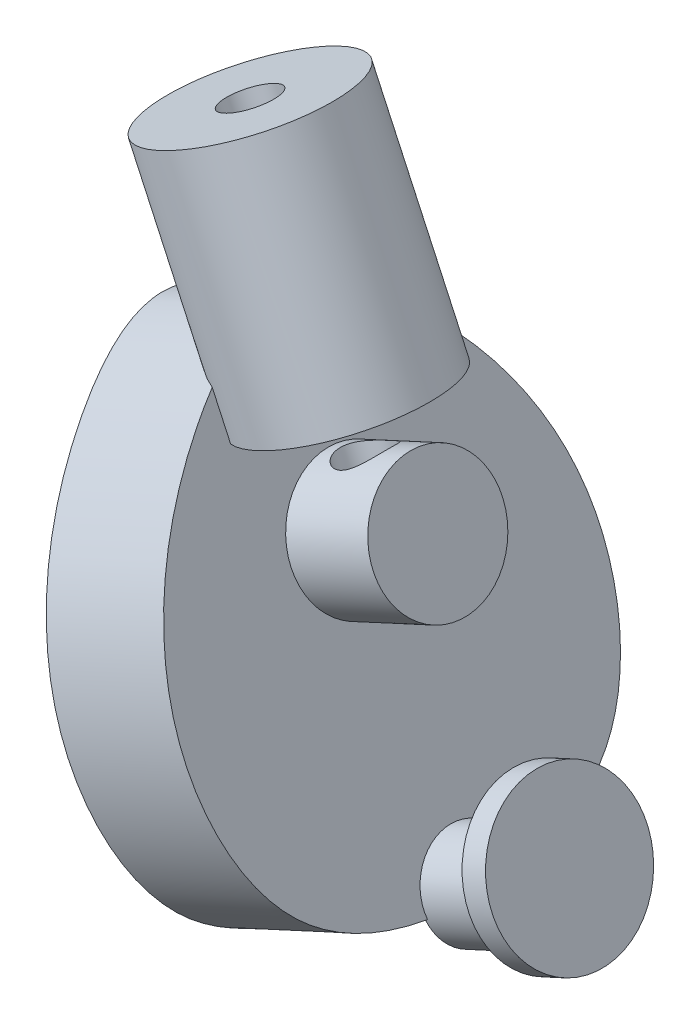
ISO-10303-21;
HEADER;
FILE_DESCRIPTION(('STEP AP214'),'2;1');
FILE_NAME('part.step','',(''),(''),'','','');
FILE_SCHEMA(('AUTOMOTIVE_DESIGN { 1 0 10303 214 1 1 1 1 }'));
ENDSEC;
DATA;
#1=APPLICATION_CONTEXT('core data for automotive mechanical design processes');
#2=APPLICATION_PROTOCOL_DEFINITION('international standard','automotive_design',2000,#1);
#3=PRODUCT_CONTEXT('',#1,'mechanical');
#4=PRODUCT('Part','Part','',(#3));
#5=PRODUCT_RELATED_PRODUCT_CATEGORY('part','',(#4));
#6=PRODUCT_DEFINITION_FORMATION('','',#4);
#7=PRODUCT_DEFINITION_CONTEXT('part definition',#1,'design');
#8=PRODUCT_DEFINITION('design','',#6,#7);
#9=PRODUCT_DEFINITION_SHAPE('','',#8);
#10=(LENGTH_UNIT() NAMED_UNIT(*) SI_UNIT(.MILLI.,.METRE.));
#11=(NAMED_UNIT(*) PLANE_ANGLE_UNIT() SI_UNIT($,.RADIAN.));
#12=(NAMED_UNIT(*) SI_UNIT($,.STERADIAN.) SOLID_ANGLE_UNIT());
#13=UNCERTAINTY_MEASURE_WITH_UNIT(LENGTH_MEASURE(1.E-05),#10,'distance_accuracy_value','');
#14=(GEOMETRIC_REPRESENTATION_CONTEXT(3) GLOBAL_UNCERTAINTY_ASSIGNED_CONTEXT((#13)) GLOBAL_UNIT_ASSIGNED_CONTEXT((#10,
#11,#12)) REPRESENTATION_CONTEXT('',''));
#15=CARTESIAN_POINT('',(0.,0.,0.));
#16=DIRECTION('',(0.,0.,1.));
#17=DIRECTION('',(1.,0.,0.));
#18=AXIS2_PLACEMENT_3D('',#15,#16,#17);
#19=CARTESIAN_POINT('',(408.232797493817,436.458394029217,0.));
#20=CARTESIAN_POINT('',(408.232797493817,436.458394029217,-1.40468515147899));
#21=CARTESIAN_POINT('',(409.460081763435,433.79927811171,-5.90286845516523));
#22=CARTESIAN_POINT('',(412.159293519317,427.950985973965,-9.07206819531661));
#23=CARTESIAN_POINT('',(415.355129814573,421.026674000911,-6.47880469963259));
#24=CARTESIAN_POINT('',(416.003077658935,419.622787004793,0.));
#25=CARTESIAN_POINT('',(415.355129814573,421.026674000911,6.4788046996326));
#26=CARTESIAN_POINT('',(412.159293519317,427.950985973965,9.07206819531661));
#27=CARTESIAN_POINT('',(409.460081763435,433.79927811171,5.90286845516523));
#28=CARTESIAN_POINT('',(408.232797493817,436.458394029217,1.40468515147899));
#29=CARTESIAN_POINT('',(408.232797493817,436.458394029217,0.));
#30=B_SPLINE_CURVE_WITH_KNOTS('',3,(#19,#20,#21,#22,#23,#24,#25,#26,#27,#28,#29),.UNSPECIFIED.,
.T.,.F.,(4,1,1,1,1,1,1,1,4),(0.,0.0859011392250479,0.275078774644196,0.378517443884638,0.5,
0.621482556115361,0.724921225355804,0.914098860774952,1.),.UNSPECIFIED.);
#31=DIRECTION('',(0.907959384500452,0.419058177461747,0.));
#32=VECTOR('',#31,1.);
#33=SURFACE_OF_LINEAR_EXTRUSION('',#30,#32);
#34=CARTESIAN_POINT('',(408.232797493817,436.458394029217,0.));
#35=VERTEX_POINT('',#34);
#36=EDGE_CURVE('E160',#35,#35,#30,.T.);
#37=ORIENTED_EDGE('',*,*,#36,.F.);
#38=EDGE_LOOP('',(#37));
#39=FACE_BOUND('',#38,.T.);
#40=CARTESIAN_POINT('',(412.772594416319,438.553684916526,0.));
#41=CARTESIAN_POINT('',(412.772594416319,438.553684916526,-1.40468515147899));
#42=CARTESIAN_POINT('',(413.999878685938,435.894568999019,-5.90286845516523));
#43=CARTESIAN_POINT('',(416.69909044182,430.046276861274,-9.07206819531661));
#44=CARTESIAN_POINT('',(419.894926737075,423.12196488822,-6.47880469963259));
#45=CARTESIAN_POINT('',(420.542874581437,421.718077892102,0.));
#46=CARTESIAN_POINT('',(419.894926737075,423.12196488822,6.4788046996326));
#47=CARTESIAN_POINT('',(416.69909044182,430.046276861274,9.07206819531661));
#48=CARTESIAN_POINT('',(413.999878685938,435.894568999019,5.90286845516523));
#49=CARTESIAN_POINT('',(412.772594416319,438.553684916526,1.40468515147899));
#50=CARTESIAN_POINT('',(412.772594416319,438.553684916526,0.));
#51=B_SPLINE_CURVE_WITH_KNOTS('',3,(#40,#41,#42,#43,#44,#45,#46,#47,#48,#49,#50),.UNSPECIFIED.,
.T.,.F.,(4,1,1,1,1,1,1,1,4),(0.,0.0859011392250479,0.275078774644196,0.378517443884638,0.5,
0.621482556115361,0.724921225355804,0.914098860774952,1.),.UNSPECIFIED.);
#52=CARTESIAN_POINT('',(413.316837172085,437.374492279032,-3.16227766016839));
#53=VERTEX_POINT('',#52);
#54=CARTESIAN_POINT('',(420.265634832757,422.318764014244,-1.77798343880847));
#55=VERTEX_POINT('',#54);
#56=EDGE_CURVE('E123',#53,#55,#51,.T.);
#57=ORIENTED_EDGE('',*,*,#56,.T.);
#58=DIRECTION('',(0.907959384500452,0.419058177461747,0.));
#59=VECTOR('',#58,1.);
#60=CARTESIAN_POINT('',(415.725837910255,420.223473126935,-1.77798343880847));
#61=LINE('',#60,#59);
#62=CARTESIAN_POINT('',(420.174838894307,422.276858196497,-1.77798343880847));
#63=VERTEX_POINT('',#62);
#64=EDGE_CURVE('E85',#55,#63,#61,.F.);
#65=ORIENTED_EDGE('',*,*,#64,.T.);
#66=CARTESIAN_POINT('',(412.681798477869,438.51177909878,0.));
#67=CARTESIAN_POINT('',(412.681798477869,438.51177909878,-1.40468515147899));
#68=CARTESIAN_POINT('',(413.909082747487,435.852663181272,-5.90286845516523));
#69=CARTESIAN_POINT('',(416.60829450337,430.004371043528,-9.07206819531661));
#70=CARTESIAN_POINT('',(419.804130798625,423.080059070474,-6.47880469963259));
#71=CARTESIAN_POINT('',(420.452078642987,421.676172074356,0.));
#72=CARTESIAN_POINT('',(419.804130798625,423.080059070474,6.4788046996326));
#73=CARTESIAN_POINT('',(416.60829450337,430.004371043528,9.07206819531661));
#74=CARTESIAN_POINT('',(413.909082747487,435.852663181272,5.90286845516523));
#75=CARTESIAN_POINT('',(412.681798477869,438.51177909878,1.40468515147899));
#76=CARTESIAN_POINT('',(412.681798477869,438.51177909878,0.));
#77=B_SPLINE_CURVE_WITH_KNOTS('',3,(#66,#67,#68,#69,#70,#71,#72,#73,#74,#75,#76),.UNSPECIFIED.,
.T.,.F.,(4,1,1,1,1,1,1,1,4),(0.,0.0859011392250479,0.275078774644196,0.378517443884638,0.5,
0.621482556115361,0.724921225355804,0.914098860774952,1.),.UNSPECIFIED.);
#78=CARTESIAN_POINT('',(420.174838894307,422.276858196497,1.77798343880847));
#79=VERTEX_POINT('',#78);
#80=EDGE_CURVE('E12',#79,#63,#77,.F.);
#81=ORIENTED_EDGE('',*,*,#80,.F.);
#82=DIRECTION('',(0.907959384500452,0.419058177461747,0.));
#83=VECTOR('',#82,1.);
#84=CARTESIAN_POINT('',(415.725837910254,420.223473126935,1.77798343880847));
#85=LINE('',#84,#83);
#86=CARTESIAN_POINT('',(420.265634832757,422.318764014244,1.77798343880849));
#87=VERTEX_POINT('',#86);
#88=EDGE_CURVE('E110',#79,#87,#85,.T.);
#89=ORIENTED_EDGE('',*,*,#88,.T.);
#90=CARTESIAN_POINT('',(413.316837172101,437.374492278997,3.16227766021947));
#91=VERTEX_POINT('',#90);
#92=EDGE_CURVE('E93',#87,#91,#51,.T.);
#93=ORIENTED_EDGE('',*,*,#92,.T.);
#94=CARTESIAN_POINT('',(413.316837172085,437.374492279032,3.16227766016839));
#95=CARTESIAN_POINT('',(413.215665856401,437.365729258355,3.11695333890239));
#96=CARTESIAN_POINT('',(413.116048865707,437.360356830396,3.06768898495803));
#97=CARTESIAN_POINT('',(412.920720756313,437.355473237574,2.961893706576));
#98=CARTESIAN_POINT('',(412.825005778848,437.355956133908,2.90537020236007));
#99=CARTESIAN_POINT('',(412.637963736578,437.361852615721,2.78550724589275));
#100=CARTESIAN_POINT('',(412.546641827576,437.367271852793,2.7221600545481));
#101=CARTESIAN_POINT('',(412.369106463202,437.382120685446,2.58912213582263));
#102=CARTESIAN_POINT('',(412.282894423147,437.39155138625,2.51942966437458));
#103=CARTESIAN_POINT('',(412.033333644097,437.424448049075,2.30174983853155));
#104=CARTESIAN_POINT('',(411.878259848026,437.452558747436,2.14464795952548));
#105=CARTESIAN_POINT('',(411.666896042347,437.498498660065,1.89229841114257));
#106=CARTESIAN_POINT('',(411.599972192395,437.514444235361,1.80538151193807));
#107=CARTESIAN_POINT('',(411.474047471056,437.546622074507,1.62606899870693));
#108=CARTESIAN_POINT('',(411.415043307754,437.562854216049,1.53367568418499));
#109=CARTESIAN_POINT('',(411.280876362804,437.601875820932,1.29973144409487));
#110=CARTESIAN_POINT('',(411.210757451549,437.624248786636,1.15511050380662));
#111=CARTESIAN_POINT('',(411.123066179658,437.653821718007,0.931028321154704));
#112=CARTESIAN_POINT('',(411.096756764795,437.663012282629,0.855171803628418));
#113=CARTESIAN_POINT('',(411.05047675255,437.679586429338,0.701371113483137));
#114=CARTESIAN_POINT('',(411.030502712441,437.686970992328,0.62342809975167));
#115=CARTESIAN_POINT('',(410.997212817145,437.699527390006,0.464964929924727));
#116=CARTESIAN_POINT('',(410.983979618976,437.704671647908,0.384425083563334));
#117=CARTESIAN_POINT('',(410.96498968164,437.712172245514,0.222374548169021));
#118=CARTESIAN_POINT('',(410.959228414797,437.714530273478,0.140864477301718));
#119=CARTESIAN_POINT('',(410.955486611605,437.716045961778,-0.0223598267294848));
#120=CARTESIAN_POINT('',(410.957504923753,437.715204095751,-0.104074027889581));
#121=CARTESIAN_POINT('',(410.969177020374,437.71051729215,-0.266846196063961));
#122=CARTESIAN_POINT('',(410.978831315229,437.706672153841,-0.34790411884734));
#123=CARTESIAN_POINT('',(411.014644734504,437.692845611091,-0.564558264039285));
#124=CARTESIAN_POINT('',(411.047610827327,437.680456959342,-0.698917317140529));
#125=CARTESIAN_POINT('',(411.131820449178,437.650685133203,-0.961122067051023));
#126=CARTESIAN_POINT('',(411.18308243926,437.633296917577,-1.08896103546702));
#127=CARTESIAN_POINT('',(411.330511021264,437.586681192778,-1.39840813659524));
#128=CARTESIAN_POINT('',(411.436335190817,437.555862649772,-1.57518844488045));
#129=CARTESIAN_POINT('',(411.675446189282,437.49562372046,-1.90953894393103));
#130=CARTESIAN_POINT('',(411.808798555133,437.46620688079,-2.06706183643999));
#131=CARTESIAN_POINT('',(412.100845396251,437.414428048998,-2.36506855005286));
#132=CARTESIAN_POINT('',(412.260044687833,437.392240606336,-2.50508658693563));
#133=CARTESIAN_POINT('',(412.596970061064,437.362227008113,-2.76180839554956));
#134=CARTESIAN_POINT('',(412.774635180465,437.354355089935,-2.87858539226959));
#135=CARTESIAN_POINT('',(413.017593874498,437.357554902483,-3.01492623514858));
#136=CARTESIAN_POINT('',(413.076575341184,437.359348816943,-3.04632390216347));
#137=CARTESIAN_POINT('',(413.195794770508,437.365185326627,-3.10638133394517));
#138=CARTESIAN_POINT('',(413.256032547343,437.369227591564,-3.13504150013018));
#139=CARTESIAN_POINT('',(413.316837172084,437.374492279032,-3.16227766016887));
#140=B_SPLINE_CURVE_WITH_KNOTS('',3,(#94,#95,#96,#97,#98,#99,#100,#101,#102,#103,#104,#105,#106,
#107,#108,#109,#110,#111,#112,#113,#114,#115,#116,#117,#118,#119,#120,#121,#122,#123,#124,#125,
#126,#127,#128,#129,#130,#131,#132,#133,#134,#135,#136,#137,#138,#139),.UNSPECIFIED.,.F.,.F.,(4,
2,2,2,2,2,2,2,2,2,2,2,2,2,2,2,2,2,2,2,2,2,4),(0.,0.333374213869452,0.666410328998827,
0.999828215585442,1.33333802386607,1.99753459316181,2.32975560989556,2.661838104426,
3.14660495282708,3.38880951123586,3.6308822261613,3.87585582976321,4.12068092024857,
4.36546977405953,4.61027499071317,5.02517048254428,5.44048580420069,6.0620638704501,
6.68513916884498,7.32230228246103,7.95742496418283,8.15786844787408,8.35828249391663),.UNSPECIFIED.);
#141=EDGE_CURVE('E154',#91,#53,#140,.T.);
#142=ORIENTED_EDGE('',*,*,#141,.T.);
#143=EDGE_LOOP('',(#57,#65,#81,#89,#93,#142));
#144=FACE_BOUND('',#143,.T.);
#145=ADVANCED_FACE('F67',(#39,#144),#33,.F.);
#146=CARTESIAN_POINT('',(415.775844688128,420.115125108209,0.));
#147=DIRECTION('',(-0.907959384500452,-0.419058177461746,0.));
#148=DIRECTION('',(0.419058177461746,-0.907959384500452,0.));
#149=AXIS2_PLACEMENT_3D('',#146,#147,#148);
#150=PLANE('',#149);
#151=CARTESIAN_POINT('',(411.166204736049,430.102678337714,0.));
#152=DIRECTION('',(-0.907959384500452,-0.419058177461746,0.));
#153=DIRECTION('',(0.419058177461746,-0.907959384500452,0.));
#154=AXIS2_PLACEMENT_3D('',#151,#152,#153);
#155=CIRCLE('',#154,2.5);
#156=CARTESIAN_POINT('',(412.213850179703,427.832779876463,0.));
#157=VERTEX_POINT('',#156);
#158=EDGE_CURVE('E144',#157,#157,#155,.T.);
#159=ORIENTED_EDGE('',*,*,#158,.F.);
#160=EDGE_LOOP('',(#159));
#161=FACE_BOUND('',#160,.T.);
#162=ORIENTED_EDGE('',*,*,#36,.T.);
#163=EDGE_LOOP('',(#162));
#164=FACE_BOUND('',#163,.T.);
#165=ADVANCED_FACE('F183',(#161,#164),#150,.T.);
#166=CARTESIAN_POINT('',(420.31564161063,422.210415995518,0.));
#167=DIRECTION('',(-0.907959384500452,-0.419058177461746,0.));
#168=DIRECTION('',(0.419058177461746,-0.907959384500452,0.));
#169=AXIS2_PLACEMENT_3D('',#166,#167,#168);
#170=PLANE('',#169);
#171=CARTESIAN_POINT('',(415.706001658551,432.197969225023,0.));
#172=DIRECTION('',(-0.907959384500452,-0.419058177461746,0.));
#173=DIRECTION('',(0.419058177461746,-0.907959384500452,0.));
#174=AXIS2_PLACEMENT_3D('',#171,#172,#173);
#175=CIRCLE('',#174,2.5);
#176=CARTESIAN_POINT('',(416.753647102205,429.928070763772,0.));
#177=VERTEX_POINT('',#176);
#178=EDGE_CURVE('E143',#177,#177,#175,.T.);
#179=ORIENTED_EDGE('',*,*,#178,.T.);
#180=EDGE_LOOP('',(#179));
#181=FACE_BOUND('',#180,.T.);
#182=ORIENTED_EDGE('',*,*,#92,.F.);
#183=CARTESIAN_POINT('',(420.148018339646,422.573599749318,0.));
#184=DIRECTION('',(-0.907959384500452,-0.419058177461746,0.));
#185=DIRECTION('',(0.419058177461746,-0.907959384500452,0.));
#186=AXIS2_PLACEMENT_3D('',#183,#184,#185);
#187=CIRCLE('',#186,1.8);
#188=EDGE_CURVE('E78',#87,#55,#187,.T.);
#189=ORIENTED_EDGE('',*,*,#188,.T.);
#190=ORIENTED_EDGE('',*,*,#56,.F.);
#191=DIRECTION('',(0.419058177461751,-0.90795938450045,0.));
#192=VECTOR('',#191,1.);
#193=CARTESIAN_POINT('',(410.258245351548,444.001441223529,-3.16227766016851));
#194=LINE('',#193,#192);
#195=CARTESIAN_POINT('',(414.029768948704,435.829806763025,-3.16227766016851));
#196=VERTEX_POINT('',#195);
#197=EDGE_CURVE('E147',#53,#196,#194,.T.);
#198=ORIENTED_EDGE('',*,*,#197,.T.);
#199=DIRECTION('',(0.,0.,1.));
#200=VECTOR('',#199,1.);
#201=CARTESIAN_POINT('',(414.029768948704,435.829806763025,0.));
#202=LINE('',#201,#200);
#203=CARTESIAN_POINT('',(414.029768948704,435.829806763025,3.16227766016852));
#204=VERTEX_POINT('',#203);
#205=EDGE_CURVE('E201',#196,#204,#202,.T.);
#206=ORIENTED_EDGE('',*,*,#205,.T.);
#207=DIRECTION('',(0.419058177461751,-0.90795938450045,0.));
#208=VECTOR('',#207,1.);
#209=CARTESIAN_POINT('',(410.258245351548,444.001441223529,3.16227766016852));
#210=LINE('',#209,#208);
#211=EDGE_CURVE('E199',#204,#91,#210,.F.);
#212=ORIENTED_EDGE('',*,*,#211,.T.);
#213=EDGE_LOOP('',(#182,#189,#190,#198,#206,#212));
#214=FACE_BOUND('',#213,.T.);
#215=ADVANCED_FACE('F177',(#181,#214),#170,.F.);
#216=CARTESIAN_POINT('',(415.391708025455,436.458394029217,0.));
#217=DIRECTION('',(0.419058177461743,-0.907959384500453,0.));
#218=DIRECTION('',(0.907959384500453,0.419058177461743,0.));
#219=AXIS2_PLACEMENT_3D('',#216,#217,#218);
#220=PLANE('',#219);
#221=CARTESIAN_POINT('',(415.391708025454,436.458394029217,0.));
#222=DIRECTION('',(0.419058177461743,-0.907959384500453,0.));
#223=DIRECTION('',(0.907959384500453,0.419058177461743,0.));
#224=AXIS2_PLACEMENT_3D('',#221,#222,#223);
#225=CIRCLE('',#224,0.999999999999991);
#226=CARTESIAN_POINT('',(416.299667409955,436.877452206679,0.));
#227=VERTEX_POINT('',#226);
#228=EDGE_CURVE('E134',#227,#227,#225,.T.);
#229=ORIENTED_EDGE('',*,*,#228,.F.);
#230=EDGE_LOOP('',(#229));
#231=FACE_BOUND('',#230,.T.);
#232=ORIENTED_EDGE('',*,*,#205,.F.);
#233=CARTESIAN_POINT('',(415.391708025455,436.458394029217,0.));
#234=DIRECTION('',(0.419058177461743,-0.907959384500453,0.));
#235=DIRECTION('',(0.907959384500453,0.419058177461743,0.));
#236=AXIS2_PLACEMENT_3D('',#233,#234,#235);
#237=CIRCLE('',#236,3.50000000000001);
#238=EDGE_CURVE('E151',#196,#204,#237,.T.);
#239=ORIENTED_EDGE('',*,*,#238,.T.);
#240=EDGE_LOOP('',(#232,#239));
#241=FACE_BOUND('',#240,.T.);
#242=ADVANCED_FACE('F171',(#231,#241),#220,.T.);
#243=CARTESIAN_POINT('',(411.620184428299,444.630028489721,0.));
#244=DIRECTION('',(0.419058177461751,-0.90795938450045,0.));
#245=DIRECTION('',(0.90795938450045,0.419058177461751,0.));
#246=AXIS2_PLACEMENT_3D('',#243,#244,#245);
#247=CYLINDRICAL_SURFACE('',#246,3.50000000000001);
#248=CARTESIAN_POINT('',(411.620184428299,444.630028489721,0.));
#249=DIRECTION('',(0.419058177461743,-0.907959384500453,0.));
#250=DIRECTION('',(0.907959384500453,0.419058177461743,0.));
#251=AXIS2_PLACEMENT_3D('',#248,#249,#250);
#252=CIRCLE('',#251,3.50000000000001);
#253=CARTESIAN_POINT('',(414.79804227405,446.096732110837,0.));
#254=VERTEX_POINT('',#253);
#255=EDGE_CURVE('E148',#254,#254,#252,.T.);
#256=ORIENTED_EDGE('',*,*,#255,.T.);
#257=EDGE_LOOP('',(#256));
#258=FACE_BOUND('',#257,.T.);
#259=ORIENTED_EDGE('',*,*,#197,.F.);
#260=ORIENTED_EDGE('',*,*,#141,.F.);
#261=ORIENTED_EDGE('',*,*,#211,.F.);
#262=ORIENTED_EDGE('',*,*,#238,.F.);
#263=EDGE_LOOP('',(#259,#260,#261,#262));
#264=FACE_BOUND('',#263,.T.);
#265=ADVANCED_FACE('F165',(#258,#264),#247,.T.);
#266=CARTESIAN_POINT('',(411.620184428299,444.630028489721,0.));
#267=DIRECTION('',(0.419058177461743,-0.907959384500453,0.));
#268=DIRECTION('',(0.907959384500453,0.419058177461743,0.));
#269=AXIS2_PLACEMENT_3D('',#266,#267,#268);
#270=PLANE('',#269);
#271=CARTESIAN_POINT('',(411.620184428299,444.630028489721,0.));
#272=DIRECTION('',(0.419058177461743,-0.907959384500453,0.));
#273=DIRECTION('',(0.907959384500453,0.419058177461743,0.));
#274=AXIS2_PLACEMENT_3D('',#271,#272,#273);
#275=CIRCLE('',#274,0.999999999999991);
#276=CARTESIAN_POINT('',(412.528143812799,445.049086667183,0.));
#277=VERTEX_POINT('',#276);
#278=EDGE_CURVE('E131',#277,#277,#275,.T.);
#279=ORIENTED_EDGE('',*,*,#278,.T.);
#280=EDGE_LOOP('',(#279));
#281=FACE_BOUND('',#280,.T.);
#282=ORIENTED_EDGE('',*,*,#255,.F.);
#283=EDGE_LOOP('',(#282));
#284=FACE_BOUND('',#283,.T.);
#285=ADVANCED_FACE('F170',(#281,#284),#270,.F.);
#286=CARTESIAN_POINT('',(418.883859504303,433.664672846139,0.));
#287=DIRECTION('',(0.907959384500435,0.419058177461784,0.));
#288=DIRECTION('',(-0.419058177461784,0.907959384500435,0.));
#289=AXIS2_PLACEMENT_3D('',#286,#287,#288);
#290=PLANE('',#289);
#291=CARTESIAN_POINT('',(418.883859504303,433.664672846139,0.));
#292=DIRECTION('',(0.907959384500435,0.419058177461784,0.));
#293=DIRECTION('',(-0.419058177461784,0.907959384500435,0.));
#294=AXIS2_PLACEMENT_3D('',#291,#292,#293);
#295=CIRCLE('',#294,2.5);
#296=CARTESIAN_POINT('',(417.836214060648,435.93457130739,0.));
#297=VERTEX_POINT('',#296);
#298=EDGE_CURVE('E140',#297,#297,#295,.T.);
#299=ORIENTED_EDGE('',*,*,#298,.T.);
#300=EDGE_LOOP('',(#299));
#301=FACE_BOUND('',#300,.T.);
#302=ADVANCED_FACE('F181',(#301),#290,.T.);
#303=CARTESIAN_POINT('',(409.804265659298,429.474091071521,0.));
#304=DIRECTION('',(0.907959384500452,0.419058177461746,0.));
#305=DIRECTION('',(-0.419058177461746,0.907959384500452,0.));
#306=AXIS2_PLACEMENT_3D('',#303,#304,#305);
#307=CYLINDRICAL_SURFACE('',#306,2.5);
#308=CARTESIAN_POINT('',(415.112335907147,434.677396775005,0.));
#309=CARTESIAN_POINT('',(415.112341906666,434.677395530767,0.0537465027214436));
#310=CARTESIAN_POINT('',(415.11702842,434.677631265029,0.107586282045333));
#311=CARTESIAN_POINT('',(415.135566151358,434.678665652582,0.213748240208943));
#312=CARTESIAN_POINT('',(415.149442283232,434.67946583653,0.266065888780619));
#313=CARTESIAN_POINT('',(415.185633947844,434.681898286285,0.367476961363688));
#314=CARTESIAN_POINT('',(415.207921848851,434.683527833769,0.416580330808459));
#315=CARTESIAN_POINT('',(415.259978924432,434.688029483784,0.510535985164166));
#316=CARTESIAN_POINT('',(415.289745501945,434.690901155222,0.555389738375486));
#317=CARTESIAN_POINT('',(415.357108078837,434.698574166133,0.641750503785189));
#318=CARTESIAN_POINT('',(415.394985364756,434.703453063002,0.683031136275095));
#319=CARTESIAN_POINT('',(415.476447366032,434.71582004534,0.759087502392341));
#320=CARTESIAN_POINT('',(415.520034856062,434.723309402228,0.793860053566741));
#321=CARTESIAN_POINT('',(415.613606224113,434.742020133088,0.857437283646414));
#322=CARTESIAN_POINT('',(415.663788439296,434.753392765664,0.885907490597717));
#323=CARTESIAN_POINT('',(415.767182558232,434.780470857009,0.933877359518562));
#324=CARTESIAN_POINT('',(415.820393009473,434.796174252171,0.953381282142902));
#325=CARTESIAN_POINT('',(415.925472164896,434.831460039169,0.981949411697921));
#326=CARTESIAN_POINT('',(415.977292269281,434.850834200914,0.991446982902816));
#327=CARTESIAN_POINT('',(416.080095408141,434.893670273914,1.00108648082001));
#328=CARTESIAN_POINT('',(416.131078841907,434.917130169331,1.0012330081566));
#329=CARTESIAN_POINT('',(416.227037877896,434.965600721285,0.992494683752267));
#330=CARTESIAN_POINT('',(416.27218465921,434.990389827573,0.984237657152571));
#331=CARTESIAN_POINT('',(416.359208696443,435.041832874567,0.959973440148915));
#332=CARTESIAN_POINT('',(416.401085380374,435.068487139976,0.943964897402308));
#333=CARTESIAN_POINT('',(416.481631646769,435.123024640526,0.904347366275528));
#334=CARTESIAN_POINT('',(416.520218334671,435.150921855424,0.880589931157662));
#335=CARTESIAN_POINT('',(416.592732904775,435.206124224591,0.826253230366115));
#336=CARTESIAN_POINT('',(416.62665902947,435.233429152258,0.795671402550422));
#337=CARTESIAN_POINT('',(416.691966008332,435.288206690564,0.725775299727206));
#338=CARTESIAN_POINT('',(416.722947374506,435.315529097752,0.685968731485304));
#339=CARTESIAN_POINT('',(416.778801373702,435.366464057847,0.600157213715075));
#340=CARTESIAN_POINT('',(416.803672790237,435.390075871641,0.554151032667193));
#341=CARTESIAN_POINT('',(416.847381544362,435.432561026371,0.4560388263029));
#342=CARTESIAN_POINT('',(416.866089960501,435.451331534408,0.403830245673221));
#343=CARTESIAN_POINT('',(416.896381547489,435.482160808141,0.295511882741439));
#344=CARTESIAN_POINT('',(416.907968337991,435.494222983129,0.239404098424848));
#345=CARTESIAN_POINT('',(416.923242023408,435.510204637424,0.128447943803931));
#346=CARTESIAN_POINT('',(416.927355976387,435.514563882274,0.0737216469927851));
#347=CARTESIAN_POINT('',(416.928888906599,435.516182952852,-0.0359226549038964));
#348=CARTESIAN_POINT('',(416.926309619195,435.513444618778,-0.0908406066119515));
#349=CARTESIAN_POINT('',(416.91480127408,435.501360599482,-0.196716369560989));
#350=CARTESIAN_POINT('',(416.906162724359,435.492317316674,-0.247741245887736));
#351=CARTESIAN_POINT('',(416.883058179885,435.468547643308,-0.347067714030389));
#352=CARTESIAN_POINT('',(416.868591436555,435.453820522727,-0.395368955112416));
#353=CARTESIAN_POINT('',(416.833575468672,435.419040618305,-0.489539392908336));
#354=CARTESIAN_POINT('',(416.812853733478,435.398838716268,-0.535289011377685));
#355=CARTESIAN_POINT('',(416.765812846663,435.354486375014,-0.621721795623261));
#356=CARTESIAN_POINT('',(416.739491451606,435.330334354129,-0.66240292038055));
#357=CARTESIAN_POINT('',(416.679612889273,435.277650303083,-0.740361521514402));
#358=CARTESIAN_POINT('',(416.645692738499,435.248934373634,-0.777236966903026));
#359=CARTESIAN_POINT('',(416.572152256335,435.190036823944,-0.843375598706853));
#360=CARTESIAN_POINT('',(416.532530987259,435.159854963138,-0.872637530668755));
#361=CARTESIAN_POINT('',(416.447669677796,435.099391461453,-0.922903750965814));
#362=CARTESIAN_POINT('',(416.402378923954,435.069111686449,-0.943825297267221));
#363=CARTESIAN_POINT('',(416.307386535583,435.010466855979,-0.976148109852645));
#364=CARTESIAN_POINT('',(416.25768818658,434.982100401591,-0.987556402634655));
#365=CARTESIAN_POINT('',(416.158969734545,434.930667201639,-0.999857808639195));
#366=CARTESIAN_POINT('',(416.110158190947,434.907365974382,-1.00144854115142));
#367=CARTESIAN_POINT('',(416.011426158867,434.864459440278,-0.99590157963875));
#368=CARTESIAN_POINT('',(415.961505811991,434.844853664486,-0.988764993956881));
#369=CARTESIAN_POINT('',(415.864164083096,434.810324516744,-0.966535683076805));
#370=CARTESIAN_POINT('',(415.816721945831,434.795246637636,-0.951768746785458));
#371=CARTESIAN_POINT('',(415.723694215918,434.768606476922,-0.915002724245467));
#372=CARTESIAN_POINT('',(415.678109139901,434.757045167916,-0.893001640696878));
#373=CARTESIAN_POINT('',(415.587518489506,434.736454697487,-0.840936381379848));
#374=CARTESIAN_POINT('',(415.542695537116,434.727608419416,-0.810482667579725));
#375=CARTESIAN_POINT('',(415.457823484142,434.712749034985,-0.742946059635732));
#376=CARTESIAN_POINT('',(415.417775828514,434.706736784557,-0.70586116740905));
#377=CARTESIAN_POINT('',(415.34127258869,434.696566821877,-0.623252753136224));
#378=CARTESIAN_POINT('',(415.30521824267,434.692554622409,-0.57733800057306));
#379=CARTESIAN_POINT('',(415.241321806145,434.686267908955,-0.479950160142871));
#380=CARTESIAN_POINT('',(415.213483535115,434.683994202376,-0.428474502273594));
#381=CARTESIAN_POINT('',(415.167774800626,434.680624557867,-0.322369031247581));
#382=CARTESIAN_POINT('',(415.149728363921,434.679507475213,-0.267815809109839));
#383=CARTESIAN_POINT('',(415.123826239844,434.677987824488,-0.156438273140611));
#384=CARTESIAN_POINT('',(415.115938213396,434.677582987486,-0.0996217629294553));
#385=CARTESIAN_POINT('',(415.112660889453,434.67741404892,-0.0284561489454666));
#386=CARTESIAN_POINT('',(415.112334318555,434.677397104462,-0.0142313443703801));
#387=CARTESIAN_POINT('',(415.112335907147,434.677396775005,0.));
#388=B_SPLINE_CURVE_WITH_KNOTS('',3,(#308,#309,#310,#311,#312,#313,#314,#315,#316,#317,#318,
#319,#320,#321,#322,#323,#324,#325,#326,#327,#328,#329,#330,#331,#332,#333,#334,#335,#336,#337,
#338,#339,#340,#341,#342,#343,#344,#345,#346,#347,#348,#349,#350,#351,#352,#353,#354,#355,#356,
#357,#358,#359,#360,#361,#362,#363,#364,#365,#366,#367,#368,#369,#370,#371,#372,#373,#374,#375,
#376,#377,#378,#379,#380,#381,#382,#383,#384,#385,#386,#387),.UNSPECIFIED.,.T.,.F.,(4,2,2,2,2,2,
2,2,2,2,2,2,2,2,2,2,2,2,2,2,2,2,2,2,2,2,2,2,2,2,2,2,2,2,2,2,2,2,2,4),(0.,0.161201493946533,
0.322841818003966,0.483955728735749,0.645013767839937,0.812986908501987,0.981041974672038,
1.15657629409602,1.33202711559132,1.49952052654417,1.66693153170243,1.82269164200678,
1.9784789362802,2.13744563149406,2.2964721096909,2.46779174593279,2.63914546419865,
2.81388456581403,2.98853478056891,3.15284592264,3.31711446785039,3.4740022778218,
3.63091024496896,3.79261756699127,3.95438979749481,4.12684237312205,4.2993233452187,
4.47347522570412,4.64749836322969,4.80899836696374,4.97047786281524,5.12557159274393,
5.28070817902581,5.44472734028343,5.60879600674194,5.78350211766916,5.95828931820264,
6.12982150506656,6.30080626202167,6.34349022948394),.UNSPECIFIED.);
#389=CARTESIAN_POINT('',(415.112335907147,434.677396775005,0.));
#390=VERTEX_POINT('',#389);
#391=EDGE_CURVE('E127',#390,#390,#388,.T.);
#392=ORIENTED_EDGE('',*,*,#391,.F.);
#393=EDGE_LOOP('',(#392));
#394=FACE_BOUND('',#393,.T.);
#395=CARTESIAN_POINT('',(419.023545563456,430.975716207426,0.));
#396=CARTESIAN_POINT('',(419.023539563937,430.975717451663,0.053746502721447));
#397=CARTESIAN_POINT('',(419.018853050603,430.975481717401,0.107586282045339));
#398=CARTESIAN_POINT('',(419.000315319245,430.974447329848,0.213748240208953));
#399=CARTESIAN_POINT('',(418.986439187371,430.973647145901,0.266065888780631));
#400=CARTESIAN_POINT('',(418.950247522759,430.971214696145,0.3674769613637));
#401=CARTESIAN_POINT('',(418.927959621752,430.969585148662,0.416580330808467));
#402=CARTESIAN_POINT('',(418.87590254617,430.965083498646,0.510535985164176));
#403=CARTESIAN_POINT('',(418.846135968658,430.962211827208,0.555389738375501));
#404=CARTESIAN_POINT('',(418.778773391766,430.954538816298,0.6417505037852));
#405=CARTESIAN_POINT('',(418.740896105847,430.949659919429,0.683031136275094));
#406=CARTESIAN_POINT('',(418.65943410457,430.93729293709,0.759087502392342));
#407=CARTESIAN_POINT('',(418.61584661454,430.929803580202,0.793860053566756));
#408=CARTESIAN_POINT('',(418.522275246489,430.911092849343,0.857437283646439));
#409=CARTESIAN_POINT('',(418.472093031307,430.899720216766,0.885907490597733));
#410=CARTESIAN_POINT('',(418.368698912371,430.872642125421,0.933877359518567));
#411=CARTESIAN_POINT('',(418.31548846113,430.856938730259,0.953381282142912));
#412=CARTESIAN_POINT('',(418.210409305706,430.821652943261,0.981949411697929));
#413=CARTESIAN_POINT('',(418.158589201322,430.802278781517,0.991446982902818));
#414=CARTESIAN_POINT('',(418.055786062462,430.759442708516,1.00108648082));
#415=CARTESIAN_POINT('',(418.004802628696,430.735982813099,1.0012330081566));
#416=CARTESIAN_POINT('',(417.908843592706,430.687512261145,0.992494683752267));
#417=CARTESIAN_POINT('',(417.863696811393,430.662723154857,0.984237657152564));
#418=CARTESIAN_POINT('',(417.77667277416,430.611280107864,0.959973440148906));
#419=CARTESIAN_POINT('',(417.734796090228,430.584625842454,0.943964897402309));
#420=CARTESIAN_POINT('',(417.654249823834,430.530088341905,0.904347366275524));
#421=CARTESIAN_POINT('',(417.615663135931,430.502191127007,0.880589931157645));
#422=CARTESIAN_POINT('',(417.543148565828,430.446988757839,0.826253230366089));
#423=CARTESIAN_POINT('',(417.509222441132,430.419683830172,0.795671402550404));
#424=CARTESIAN_POINT('',(417.44391546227,430.364906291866,0.725775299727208));
#425=CARTESIAN_POINT('',(417.412934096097,430.337583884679,0.68596873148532));
#426=CARTESIAN_POINT('',(417.357080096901,430.286648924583,0.600157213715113));
#427=CARTESIAN_POINT('',(417.332208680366,430.263037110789,0.554151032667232));
#428=CARTESIAN_POINT('',(417.288499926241,430.22055195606,0.456038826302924));
#429=CARTESIAN_POINT('',(417.269791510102,430.201781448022,0.403830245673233));
#430=CARTESIAN_POINT('',(417.239499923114,430.17095217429,0.295511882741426));
#431=CARTESIAN_POINT('',(417.227913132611,430.158889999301,0.239404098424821));
#432=CARTESIAN_POINT('',(417.212639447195,430.142908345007,0.128447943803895));
#433=CARTESIAN_POINT('',(417.208525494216,430.138549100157,0.0737216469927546));
#434=CARTESIAN_POINT('',(417.206992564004,430.136930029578,-0.0359226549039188));
#435=CARTESIAN_POINT('',(417.209571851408,430.139668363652,-0.0908406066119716));
#436=CARTESIAN_POINT('',(417.221080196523,430.151752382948,-0.196716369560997));
#437=CARTESIAN_POINT('',(417.229718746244,430.160795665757,-0.247741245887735));
#438=CARTESIAN_POINT('',(417.252823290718,430.184565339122,-0.347067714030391));
#439=CARTESIAN_POINT('',(417.267290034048,430.199292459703,-0.395368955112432));
#440=CARTESIAN_POINT('',(417.302306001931,430.234072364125,-0.48953939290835));
#441=CARTESIAN_POINT('',(417.323027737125,430.254274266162,-0.535289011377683));
#442=CARTESIAN_POINT('',(417.37006862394,430.298626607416,-0.621721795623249));
#443=CARTESIAN_POINT('',(417.396390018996,430.322778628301,-0.662402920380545));
#444=CARTESIAN_POINT('',(417.456268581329,430.375462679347,-0.7403615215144));
#445=CARTESIAN_POINT('',(417.490188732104,430.404178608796,-0.777236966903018));
#446=CARTESIAN_POINT('',(417.563729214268,430.463076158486,-0.843375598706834));
#447=CARTESIAN_POINT('',(417.603350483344,430.493258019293,-0.872637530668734));
#448=CARTESIAN_POINT('',(417.688211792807,430.553721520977,-0.922903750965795));
#449=CARTESIAN_POINT('',(417.733502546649,430.584001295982,-0.943825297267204));
#450=CARTESIAN_POINT('',(417.828494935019,430.642646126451,-0.976148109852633));
#451=CARTESIAN_POINT('',(417.878193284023,430.671012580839,-0.987556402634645));
#452=CARTESIAN_POINT('',(417.976911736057,430.722445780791,-0.999857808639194));
#453=CARTESIAN_POINT('',(418.025723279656,430.745747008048,-1.00144854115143));
#454=CARTESIAN_POINT('',(418.124455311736,430.788653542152,-0.995901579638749));
#455=CARTESIAN_POINT('',(418.174375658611,430.808259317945,-0.988764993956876));
#456=CARTESIAN_POINT('',(418.271717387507,430.842788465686,-0.966535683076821));
#457=CARTESIAN_POINT('',(418.319159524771,430.857866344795,-0.951768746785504));
#458=CARTESIAN_POINT('',(418.412187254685,430.884506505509,-0.91500272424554));
#459=CARTESIAN_POINT('',(418.457772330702,430.896067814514,-0.893001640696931));
#460=CARTESIAN_POINT('',(418.548362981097,430.916658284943,-0.84093638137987));
#461=CARTESIAN_POINT('',(418.593185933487,430.925504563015,-0.81048266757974));
#462=CARTESIAN_POINT('',(418.678057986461,430.940363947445,-0.742946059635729));
#463=CARTESIAN_POINT('',(418.718105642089,430.946376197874,-0.705861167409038));
#464=CARTESIAN_POINT('',(418.794608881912,430.956546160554,-0.623252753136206));
#465=CARTESIAN_POINT('',(418.830663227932,430.960558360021,-0.577338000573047));
#466=CARTESIAN_POINT('',(418.894559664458,430.966845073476,-0.479950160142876));
#467=CARTESIAN_POINT('',(418.922397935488,430.969118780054,-0.428474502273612));
#468=CARTESIAN_POINT('',(418.968106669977,430.972488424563,-0.322369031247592));
#469=CARTESIAN_POINT('',(418.986153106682,430.973605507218,-0.267815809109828));
#470=CARTESIAN_POINT('',(419.012055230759,430.975125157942,-0.156438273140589));
#471=CARTESIAN_POINT('',(419.019943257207,430.975529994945,-0.0996217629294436));
#472=CARTESIAN_POINT('',(419.023220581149,430.97569893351,-0.0284561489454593));
#473=CARTESIAN_POINT('',(419.023547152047,430.975715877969,-0.0142313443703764));
#474=CARTESIAN_POINT('',(419.023545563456,430.975716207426,0.));
#475=B_SPLINE_CURVE_WITH_KNOTS('',3,(#395,#396,#397,#398,#399,#400,#401,#402,#403,#404,#405,
#406,#407,#408,#409,#410,#411,#412,#413,#414,#415,#416,#417,#418,#419,#420,#421,#422,#423,#424,
#425,#426,#427,#428,#429,#430,#431,#432,#433,#434,#435,#436,#437,#438,#439,#440,#441,#442,#443,
#444,#445,#446,#447,#448,#449,#450,#451,#452,#453,#454,#455,#456,#457,#458,#459,#460,#461,#462,
#463,#464,#465,#466,#467,#468,#469,#470,#471,#472,#473,#474),.UNSPECIFIED.,.T.,.F.,(4,2,2,2,2,2,
2,2,2,2,2,2,2,2,2,2,2,2,2,2,2,2,2,2,2,2,2,2,2,2,2,2,2,2,2,2,2,2,2,4),(0.,0.161201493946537,
0.322841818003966,0.483955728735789,0.645013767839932,0.812986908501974,0.981041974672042,
1.15657629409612,1.33202711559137,1.49952052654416,1.6669315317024,1.82269164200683,
1.97847893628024,2.13744563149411,2.29647210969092,2.4677917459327,2.63914546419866,
2.81388456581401,2.98853478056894,3.15284592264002,3.31711446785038,3.4740022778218,
3.63091024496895,3.79261756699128,3.95438979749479,4.12684237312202,4.29932334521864,
4.47347522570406,4.64749836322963,4.80899836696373,4.97047786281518,5.12557159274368,
5.28070817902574,5.44472734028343,5.60879600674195,5.78350211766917,5.95828931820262,
6.12982150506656,6.30080626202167,6.34349022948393),.UNSPECIFIED.);
#476=CARTESIAN_POINT('',(419.023545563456,430.975716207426,0.));
#477=VERTEX_POINT('',#476);
#478=EDGE_CURVE('E124',#477,#477,#475,.T.);
#479=ORIENTED_EDGE('',*,*,#478,.F.);
#480=EDGE_LOOP('',(#479));
#481=FACE_BOUND('',#480,.T.);
#482=ORIENTED_EDGE('',*,*,#298,.F.);
#483=EDGE_LOOP('',(#482));
#484=FACE_BOUND('',#483,.T.);
#485=ORIENTED_EDGE('',*,*,#178,.F.);
#486=EDGE_LOOP('',(#485));
#487=FACE_BOUND('',#486,.T.);
#488=ADVANCED_FACE('F294',(#394,#481,#484,#487),#307,.T.);
#489=CARTESIAN_POINT('',(409.804265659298,429.474091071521,0.));
#490=DIRECTION('',(0.907959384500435,0.419058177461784,0.));
#491=DIRECTION('',(-0.419058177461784,0.907959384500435,0.));
#492=AXIS2_PLACEMENT_3D('',#489,#490,#491);
#493=PLANE('',#492);
#494=CARTESIAN_POINT('',(409.804265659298,429.474091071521,0.));
#495=DIRECTION('',(0.907959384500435,0.419058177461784,0.));
#496=DIRECTION('',(-0.419058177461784,0.907959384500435,0.));
#497=AXIS2_PLACEMENT_3D('',#494,#495,#496);
#498=CIRCLE('',#497,2.5);
#499=CARTESIAN_POINT('',(408.756620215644,431.743989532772,0.));
#500=VERTEX_POINT('',#499);
#501=EDGE_CURVE('E137',#500,#500,#498,.T.);
#502=ORIENTED_EDGE('',*,*,#501,.F.);
#503=EDGE_LOOP('',(#502));
#504=FACE_BOUND('',#503,.T.);
#505=ADVANCED_FACE('F173',(#504),#493,.F.);
#506=ORIENTED_EDGE('',*,*,#158,.T.);
#507=EDGE_LOOP('',(#506));
#508=FACE_BOUND('',#507,.T.);
#509=ORIENTED_EDGE('',*,*,#501,.T.);
#510=EDGE_LOOP('',(#509));
#511=FACE_BOUND('',#510,.T.);
#512=ADVANCED_FACE('F222',(#508,#511),#307,.T.);
#513=CARTESIAN_POINT('',(410.782068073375,446.445947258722,0.));
#514=DIRECTION('',(0.419058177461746,-0.907959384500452,0.));
#515=DIRECTION('',(0.907959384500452,0.419058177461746,0.));
#516=AXIS2_PLACEMENT_3D('',#513,#514,#515);
#517=CYLINDRICAL_SURFACE('',#516,0.999999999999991);
#518=ORIENTED_EDGE('',*,*,#391,.T.);
#519=EDGE_LOOP('',(#518));
#520=FACE_BOUND('',#519,.T.);
#521=ORIENTED_EDGE('',*,*,#478,.T.);
#522=EDGE_LOOP('',(#521));
#523=FACE_BOUND('',#522,.T.);
#524=ADVANCED_FACE('F224',(#520,#523),#517,.F.);
#525=ORIENTED_EDGE('',*,*,#228,.T.);
#526=EDGE_LOOP('',(#525));
#527=FACE_BOUND('',#526,.T.);
#528=ORIENTED_EDGE('',*,*,#278,.F.);
#529=EDGE_LOOP('',(#528));
#530=FACE_BOUND('',#529,.T.);
#531=ADVANCED_FACE('F228',(#527,#530),#517,.F.);
#532=CARTESIAN_POINT('',(420.057222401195,422.531693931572,0.));
#533=DIRECTION('',(0.907959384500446,0.419058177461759,0.));
#534=DIRECTION('',(-0.419058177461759,0.907959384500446,0.));
#535=AXIS2_PLACEMENT_3D('',#532,#533,#534);
#536=PLANE('',#535);
#537=CARTESIAN_POINT('',(420.057222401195,422.531693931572,0.));
#538=DIRECTION('',(0.907959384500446,0.419058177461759,0.));
#539=DIRECTION('',(-0.419058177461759,0.907959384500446,0.));
#540=AXIS2_PLACEMENT_3D('',#537,#538,#539);
#541=CIRCLE('',#540,1.8);
#542=EDGE_CURVE('E113',#79,#63,#541,.T.);
#543=ORIENTED_EDGE('',*,*,#542,.F.);
#544=ORIENTED_EDGE('',*,*,#80,.T.);
#545=EDGE_LOOP('',(#543,#544));
#546=FACE_BOUND('',#545,.T.);
#547=ADVANCED_FACE('F118',(#546),#536,.F.);
#548=CARTESIAN_POINT('',(420.057222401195,422.531693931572,0.));
#549=DIRECTION('',(0.907959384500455,0.41905817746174,0.));
#550=DIRECTION('',(-0.41905817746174,0.907959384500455,0.));
#551=AXIS2_PLACEMENT_3D('',#548,#549,#550);
#552=CYLINDRICAL_SURFACE('',#551,1.8);
#553=CARTESIAN_POINT('',(423.325876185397,424.040303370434,0.));
#554=DIRECTION('',(0.907959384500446,0.419058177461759,0.));
#555=DIRECTION('',(-0.419058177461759,0.907959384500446,0.));
#556=AXIS2_PLACEMENT_3D('',#553,#554,#555);
#557=CIRCLE('',#556,1.8);
#558=CARTESIAN_POINT('',(422.571571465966,425.674630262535,0.));
#559=VERTEX_POINT('',#558);
#560=EDGE_CURVE('E115',#559,#559,#557,.T.);
#561=ORIENTED_EDGE('',*,*,#560,.F.);
#562=EDGE_LOOP('',(#561));
#563=FACE_BOUND('',#562,.T.);
#564=ORIENTED_EDGE('',*,*,#64,.F.);
#565=ORIENTED_EDGE('',*,*,#188,.F.);
#566=ORIENTED_EDGE('',*,*,#88,.F.);
#567=ORIENTED_EDGE('',*,*,#542,.T.);
#568=EDGE_LOOP('',(#564,#565,#566,#567));
#569=FACE_BOUND('',#568,.T.);
#570=ADVANCED_FACE('F112',(#563,#569),#552,.T.);
#571=CARTESIAN_POINT('',(423.07444127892,424.585079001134,0.));
#572=DIRECTION('',(0.907959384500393,0.419058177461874,0.));
#573=DIRECTION('',(-0.419058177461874,0.907959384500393,0.));
#574=AXIS2_PLACEMENT_3D('',#571,#572,#573);
#575=PLANE('',#574);
#576=ORIENTED_EDGE('',*,*,#560,.T.);
#577=EDGE_LOOP('',(#576));
#578=FACE_BOUND('',#577,.T.);
#579=CARTESIAN_POINT('',(423.07444127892,424.585079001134,0.));
#580=DIRECTION('',(0.907959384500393,0.419058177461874,0.));
#581=DIRECTION('',(-0.419058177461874,0.907959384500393,0.));
#582=AXIS2_PLACEMENT_3D('',#579,#580,#581);
#583=CIRCLE('',#582,3.);
#584=CARTESIAN_POINT('',(421.817266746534,427.308957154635,0.));
#585=VERTEX_POINT('',#584);
#586=EDGE_CURVE('E254',#585,#585,#583,.T.);
#587=ORIENTED_EDGE('',*,*,#586,.F.);
#588=EDGE_LOOP('',(#587));
#589=FACE_BOUND('',#588,.T.);
#590=ADVANCED_FACE('F235',(#578,#589),#575,.F.);
#591=CARTESIAN_POINT('',(423.98240066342,425.004137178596,0.));
#592=DIRECTION('',(0.907959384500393,0.419058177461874,0.));
#593=DIRECTION('',(-0.419058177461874,0.907959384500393,0.));
#594=AXIS2_PLACEMENT_3D('',#591,#592,#593);
#595=PLANE('',#594);
#596=CARTESIAN_POINT('',(423.98240066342,425.004137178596,0.));
#597=DIRECTION('',(0.907959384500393,0.419058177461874,0.));
#598=DIRECTION('',(-0.419058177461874,0.907959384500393,0.));
#599=AXIS2_PLACEMENT_3D('',#596,#597,#598);
#600=CIRCLE('',#599,3.);
#601=CARTESIAN_POINT('',(422.725226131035,427.728015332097,0.));
#602=VERTEX_POINT('',#601);
#603=EDGE_CURVE('E119',#602,#602,#600,.T.);
#604=ORIENTED_EDGE('',*,*,#603,.T.);
#605=EDGE_LOOP('',(#604));
#606=FACE_BOUND('',#605,.T.);
#607=ADVANCED_FACE('F240',(#606),#595,.T.);
#608=CARTESIAN_POINT('',(423.07444127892,424.585079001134,0.));
#609=DIRECTION('',(0.907959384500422,0.41905817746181,0.));
#610=DIRECTION('',(-0.41905817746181,0.907959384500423,0.));
#611=AXIS2_PLACEMENT_3D('',#608,#609,#610);
#612=CYLINDRICAL_SURFACE('',#611,3.);
#613=CARTESIAN_POINT('',(422.725226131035,427.728015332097,0.));
#614=CARTESIAN_POINT('',(422.71576822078,427.723650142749,0.));
#615=CARTESIAN_POINT('',(422.706310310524,427.7192849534,0.));
#616=CARTESIAN_POINT('',(422.687394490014,427.710554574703,0.));
#617=CARTESIAN_POINT('',(422.677936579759,427.706189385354,0.));
#618=CARTESIAN_POINT('',(422.659020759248,427.697459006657,0.));
#619=CARTESIAN_POINT('',(422.649562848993,427.693093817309,0.));
#620=CARTESIAN_POINT('',(422.630647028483,427.684363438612,0.));
#621=CARTESIAN_POINT('',(422.621189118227,427.679998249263,0.));
#622=CARTESIAN_POINT('',(422.602273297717,427.671267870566,0.));
#623=CARTESIAN_POINT('',(422.592815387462,427.666902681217,0.));
#624=CARTESIAN_POINT('',(422.573899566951,427.65817230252,0.));
#625=CARTESIAN_POINT('',(422.564441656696,427.653807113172,0.));
#626=CARTESIAN_POINT('',(422.545525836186,427.645076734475,0.));
#627=CARTESIAN_POINT('',(422.53606792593,427.640711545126,0.));
#628=CARTESIAN_POINT('',(422.51715210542,427.631981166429,0.));
#629=CARTESIAN_POINT('',(422.507694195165,427.62761597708,0.));
#630=CARTESIAN_POINT('',(422.488778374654,427.618885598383,0.));
#631=CARTESIAN_POINT('',(422.479320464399,427.614520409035,0.));
#632=CARTESIAN_POINT('',(422.460404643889,427.605790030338,0.));
#633=CARTESIAN_POINT('',(422.450946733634,427.601424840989,0.));
#634=CARTESIAN_POINT('',(422.432030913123,427.592694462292,0.));
#635=CARTESIAN_POINT('',(422.422573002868,427.588329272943,0.));
#636=CARTESIAN_POINT('',(422.403657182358,427.579598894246,0.));
#637=CARTESIAN_POINT('',(422.394199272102,427.575233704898,0.));
#638=CARTESIAN_POINT('',(422.375283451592,427.5665033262,0.));
#639=CARTESIAN_POINT('',(422.365825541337,427.562138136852,0.));
#640=CARTESIAN_POINT('',(422.346909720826,427.553407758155,0.));
#641=CARTESIAN_POINT('',(422.337451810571,427.549042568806,0.));
#642=CARTESIAN_POINT('',(422.318535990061,427.540312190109,0.));
#643=CARTESIAN_POINT('',(422.309078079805,427.53594700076,0.));
#644=CARTESIAN_POINT('',(422.290162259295,427.527216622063,0.));
#645=CARTESIAN_POINT('',(422.28070434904,427.522851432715,0.));
#646=CARTESIAN_POINT('',(422.261788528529,427.514121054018,0.));
#647=CARTESIAN_POINT('',(422.252330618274,427.509755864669,0.));
#648=CARTESIAN_POINT('',(422.233414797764,427.501025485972,0.));
#649=CARTESIAN_POINT('',(422.223956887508,427.496660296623,0.));
#650=CARTESIAN_POINT('',(422.205041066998,427.487929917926,0.));
#651=CARTESIAN_POINT('',(422.195583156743,427.483564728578,0.));
#652=CARTESIAN_POINT('',(422.176667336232,427.474834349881,0.));
#653=CARTESIAN_POINT('',(422.167209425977,427.470469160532,0.));
#654=CARTESIAN_POINT('',(422.148293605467,427.461738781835,0.));
#655=CARTESIAN_POINT('',(422.138835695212,427.457373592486,0.));
#656=CARTESIAN_POINT('',(422.119919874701,427.448643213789,0.));
#657=CARTESIAN_POINT('',(422.110461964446,427.444278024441,0.));
#658=CARTESIAN_POINT('',(422.091546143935,427.435547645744,0.));
#659=CARTESIAN_POINT('',(422.08208823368,427.431182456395,0.));
#660=CARTESIAN_POINT('',(422.06317241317,427.422452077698,0.));
#661=CARTESIAN_POINT('',(422.053714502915,427.418086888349,0.));
#662=CARTESIAN_POINT('',(422.034798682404,427.409356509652,0.));
#663=CARTESIAN_POINT('',(422.025340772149,427.404991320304,0.));
#664=CARTESIAN_POINT('',(422.006424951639,427.396260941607,0.));
#665=CARTESIAN_POINT('',(421.996967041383,427.391895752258,0.));
#666=CARTESIAN_POINT('',(421.978051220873,427.383165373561,0.));
#667=CARTESIAN_POINT('',(421.968593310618,427.378800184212,0.));
#668=CARTESIAN_POINT('',(421.949677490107,427.370069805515,0.));
#669=CARTESIAN_POINT('',(421.940219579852,427.365704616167,0.));
#670=CARTESIAN_POINT('',(421.921303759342,427.35697423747,0.));
#671=CARTESIAN_POINT('',(421.911845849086,427.352609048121,0.));
#672=CARTESIAN_POINT('',(421.892930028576,427.343878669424,0.));
#673=CARTESIAN_POINT('',(421.883472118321,427.339513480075,0.));
#674=CARTESIAN_POINT('',(421.86455629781,427.330783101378,0.));
#675=CARTESIAN_POINT('',(421.855098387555,427.32641791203,0.));
#676=CARTESIAN_POINT('',(421.836182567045,427.317687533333,0.));
#677=CARTESIAN_POINT('',(421.82672465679,427.313322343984,0.));
#678=CARTESIAN_POINT('',(421.817266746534,427.308957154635,0.));
#679=B_SPLINE_CURVE_WITH_KNOTS('',3,(#613,#614,#615,#616,#617,#618,#619,#620,#621,#622,#623,
#624,#625,#626,#627,#628,#629,#630,#631,#632,#633,#634,#635,#636,#637,#638,#639,#640,#641,#642,
#643,#644,#645,#646,#647,#648,#649,#650,#651,#652,#653,#654,#655,#656,#657,#658,#659,#660,#661,
#662,#663,#664,#665,#666,#667,#668,#669,#670,#671,#672,#673,#674,#675,#676,#677,#678),
.UNSPECIFIED.,.F.,.F.,(4,2,2,2,2,2,2,2,2,2,2,2,2,2,2,2,2,2,2,2,2,2,2,2,2,2,2,2,2,2,2,2,4),(0.,
0.0312500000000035,0.0624999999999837,0.0937499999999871,0.124999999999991,0.156249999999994,
0.187499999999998,0.218750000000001,0.250000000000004,0.281250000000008,0.312500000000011,
0.343750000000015,0.375000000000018,0.406250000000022,0.437500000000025,0.468750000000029,
0.499999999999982,0.531249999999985,0.562499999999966,0.593749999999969,0.624999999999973,
0.656249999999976,0.68749999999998,0.718749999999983,0.749999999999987,0.78124999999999,
0.812499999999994,0.843749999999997,0.875000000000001,0.906250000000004,0.937500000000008,
0.968750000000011,1.00000000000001),.UNSPECIFIED.);
#680=EDGE_CURVE('BSEAM237',#602,#585,#679,.T.);
#681=ORIENTED_EDGE('',*,*,#603,.F.);
#682=ORIENTED_EDGE('',*,*,#586,.T.);
#683=ORIENTED_EDGE('',*,*,#680,.T.);
#684=ORIENTED_EDGE('',*,*,#680,.F.);
#685=EDGE_LOOP('',(#681,#683,#682,#684));
#686=FACE_BOUND('',#685,.T.);
#687=ADVANCED_FACE('F237',(#686),#612,.T.);
#688=CLOSED_SHELL('',(#145,#165,#215,#242,#265,#285,#302,#488,#505,#512,#524,#531,#547,#570,
#590,#607,#687));
#689=MANIFOLD_SOLID_BREP('B2',#688);
#690=ADVANCED_BREP_SHAPE_REPRESENTATION('',(#18,#689),#14);
#691=SHAPE_DEFINITION_REPRESENTATION(#9,#690);
ENDSEC;
END-ISO-10303-21;
